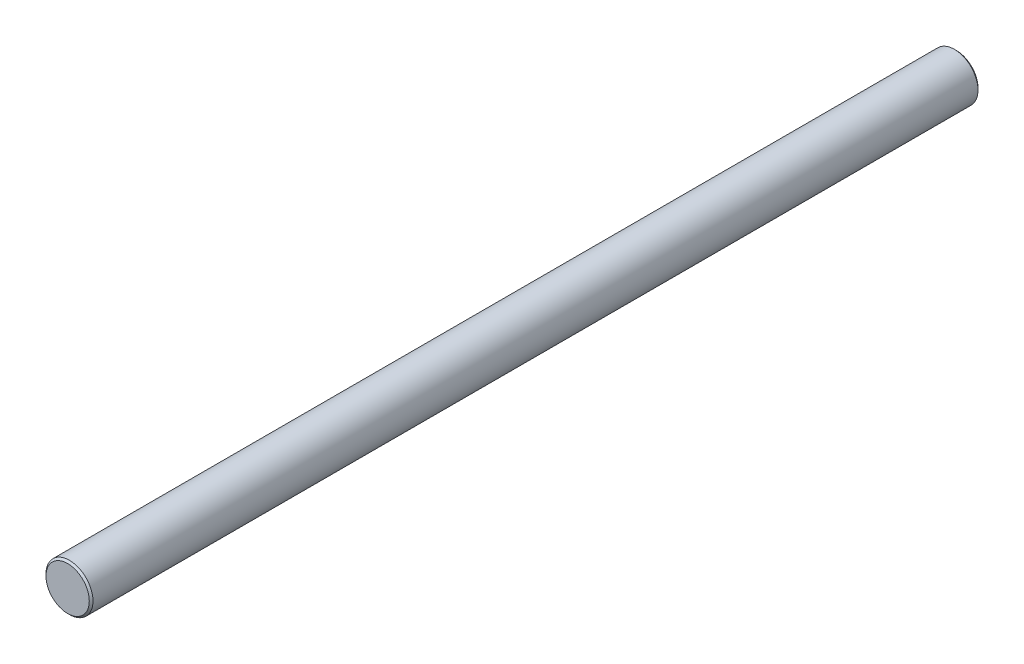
from build123d import *

# Parameters (mm, degrees)
SKETCH1_R           = 6.35
BOSS_EXTRUDE1_DEPTH = 240
CHAMFER1_SIZE       = 0.5


with BuildPart() as part:
    # Sketch1 → Boss-Extrude1 (new body)
    with BuildSketch(Plane.XY):
        Circle(SKETCH1_R)
    extrude(amount=BOSS_EXTRUDE1_DEPTH)

    # Chamfer1
    chamfer1_edges = [part.edges().sort_by_distance(p)[0] for p in [
        (-6.35, 0, 0),
        (-6.35, 0, 240),
    ]]
    chamfer(chamfer1_edges, length=CHAMFER1_SIZE)


solid = part.part
